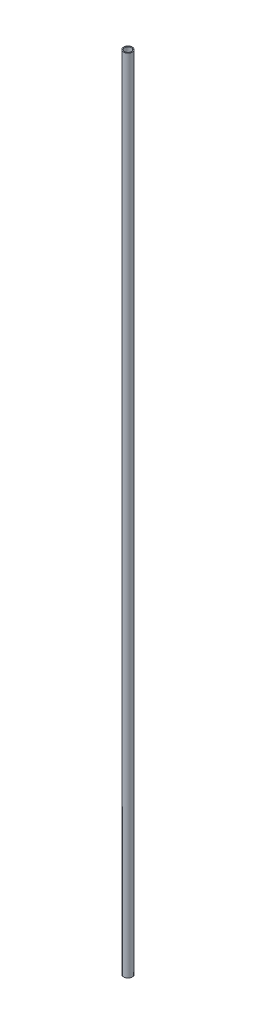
ISO-10303-21;
HEADER;
FILE_DESCRIPTION(('STEP AP214'),'2;1');
FILE_NAME('part.step','',(''),(''),'','','');
FILE_SCHEMA(('AUTOMOTIVE_DESIGN { 1 0 10303 214 1 1 1 1 }'));
ENDSEC;
DATA;
#1=APPLICATION_CONTEXT('core data for automotive mechanical design processes');
#2=APPLICATION_PROTOCOL_DEFINITION('international standard','automotive_design',2000,#1);
#3=PRODUCT_CONTEXT('',#1,'mechanical');
#4=PRODUCT('Part','Part','',(#3));
#5=PRODUCT_RELATED_PRODUCT_CATEGORY('part','',(#4));
#6=PRODUCT_DEFINITION_FORMATION('','',#4);
#7=PRODUCT_DEFINITION_CONTEXT('part definition',#1,'design');
#8=PRODUCT_DEFINITION('design','',#6,#7);
#9=PRODUCT_DEFINITION_SHAPE('','',#8);
#10=(LENGTH_UNIT() NAMED_UNIT(*) SI_UNIT(.MILLI.,.METRE.));
#11=(NAMED_UNIT(*) PLANE_ANGLE_UNIT() SI_UNIT($,.RADIAN.));
#12=(NAMED_UNIT(*) SI_UNIT($,.STERADIAN.) SOLID_ANGLE_UNIT());
#13=UNCERTAINTY_MEASURE_WITH_UNIT(LENGTH_MEASURE(1.E-05),#10,'distance_accuracy_value','');
#14=(GEOMETRIC_REPRESENTATION_CONTEXT(3) GLOBAL_UNCERTAINTY_ASSIGNED_CONTEXT((#13)) GLOBAL_UNIT_ASSIGNED_CONTEXT((#10,
#11,#12)) REPRESENTATION_CONTEXT('',''));
#15=CARTESIAN_POINT('',(0.,0.,0.));
#16=DIRECTION('',(0.,0.,1.));
#17=DIRECTION('',(1.,0.,0.));
#18=AXIS2_PLACEMENT_3D('',#15,#16,#17);
#19=CARTESIAN_POINT('',(0.,3048.,0.));
#20=DIRECTION('',(0.,1.,0.));
#21=DIRECTION('',(0.,0.,1.));
#22=AXIS2_PLACEMENT_3D('',#19,#20,#21);
#23=PLANE('',#22);
#24=CARTESIAN_POINT('',(0.,3048.,0.));
#25=DIRECTION('',(0.,1.,0.));
#26=DIRECTION('',(0.,0.,1.));
#27=AXIS2_PLACEMENT_3D('',#24,#25,#26);
#28=CIRCLE('',#27,16.7005);
#29=CARTESIAN_POINT('',(0.,3048.,16.7005));
#30=VERTEX_POINT('',#29);
#31=EDGE_CURVE('E10',#30,#30,#28,.T.);
#32=ORIENTED_EDGE('',*,*,#31,.T.);
#33=EDGE_LOOP('',(#32));
#34=FACE_BOUND('',#33,.T.);
#35=CARTESIAN_POINT('',(0.,3048.,0.));
#36=DIRECTION('',(0.,1.,0.));
#37=DIRECTION('',(0.,0.,1.));
#38=AXIS2_PLACEMENT_3D('',#35,#36,#37);
#39=CIRCLE('',#38,13.0683);
#40=CARTESIAN_POINT('',(0.,3048.,13.0683));
#41=VERTEX_POINT('',#40);
#42=EDGE_CURVE('E54',#41,#41,#39,.T.);
#43=ORIENTED_EDGE('',*,*,#42,.F.);
#44=EDGE_LOOP('',(#43));
#45=FACE_BOUND('',#44,.T.);
#46=ADVANCED_FACE('F41',(#34,#45),#23,.T.);
#47=CARTESIAN_POINT('',(0.,0.,0.));
#48=DIRECTION('',(0.,1.,0.));
#49=DIRECTION('',(0.,0.,1.));
#50=AXIS2_PLACEMENT_3D('',#47,#48,#49);
#51=PLANE('',#50);
#52=CARTESIAN_POINT('',(0.,0.,0.));
#53=DIRECTION('',(0.,1.,0.));
#54=DIRECTION('',(0.,0.,1.));
#55=AXIS2_PLACEMENT_3D('',#52,#53,#54);
#56=CIRCLE('',#55,16.7005);
#57=CARTESIAN_POINT('',(0.,0.,16.7005));
#58=VERTEX_POINT('',#57);
#59=EDGE_CURVE('E45',#58,#58,#56,.T.);
#60=ORIENTED_EDGE('',*,*,#59,.F.);
#61=EDGE_LOOP('',(#60));
#62=FACE_BOUND('',#61,.T.);
#63=CARTESIAN_POINT('',(0.,0.,0.));
#64=DIRECTION('',(0.,1.,0.));
#65=DIRECTION('',(0.,0.,1.));
#66=AXIS2_PLACEMENT_3D('',#63,#64,#65);
#67=CIRCLE('',#66,13.0683);
#68=CARTESIAN_POINT('',(0.,0.,13.0683));
#69=VERTEX_POINT('',#68);
#70=EDGE_CURVE('E56',#69,#69,#67,.T.);
#71=ORIENTED_EDGE('',*,*,#70,.T.);
#72=EDGE_LOOP('',(#71));
#73=FACE_BOUND('',#72,.T.);
#74=ADVANCED_FACE('F68',(#62,#73),#51,.F.);
#75=CARTESIAN_POINT('',(0.,3048.,0.));
#76=DIRECTION('',(0.,-1.,0.));
#77=DIRECTION('',(0.,0.,-1.));
#78=AXIS2_PLACEMENT_3D('',#75,#76,#77);
#79=CYLINDRICAL_SURFACE('',#78,16.7005);
#80=ORIENTED_EDGE('',*,*,#31,.F.);
#81=EDGE_LOOP('',(#80));
#82=FACE_BOUND('',#81,.T.);
#83=ORIENTED_EDGE('',*,*,#59,.T.);
#84=EDGE_LOOP('',(#83));
#85=FACE_BOUND('',#84,.T.);
#86=ADVANCED_FACE('F43',(#82,#85),#79,.T.);
#87=CARTESIAN_POINT('',(0.,3048.,0.));
#88=DIRECTION('',(0.,-1.,0.));
#89=DIRECTION('',(0.,0.,-1.));
#90=AXIS2_PLACEMENT_3D('',#87,#88,#89);
#91=CYLINDRICAL_SURFACE('',#90,13.0683);
#92=ORIENTED_EDGE('',*,*,#42,.T.);
#93=EDGE_LOOP('',(#92));
#94=FACE_BOUND('',#93,.T.);
#95=ORIENTED_EDGE('',*,*,#70,.F.);
#96=EDGE_LOOP('',(#95));
#97=FACE_BOUND('',#96,.T.);
#98=ADVANCED_FACE('F64',(#94,#97),#91,.F.);
#99=CLOSED_SHELL('',(#46,#74,#86,#98));
#100=MANIFOLD_SOLID_BREP('B2',#99);
#101=ADVANCED_BREP_SHAPE_REPRESENTATION('',(#18,#100),#14);
#102=SHAPE_DEFINITION_REPRESENTATION(#9,#101);
ENDSEC;
END-ISO-10303-21;
